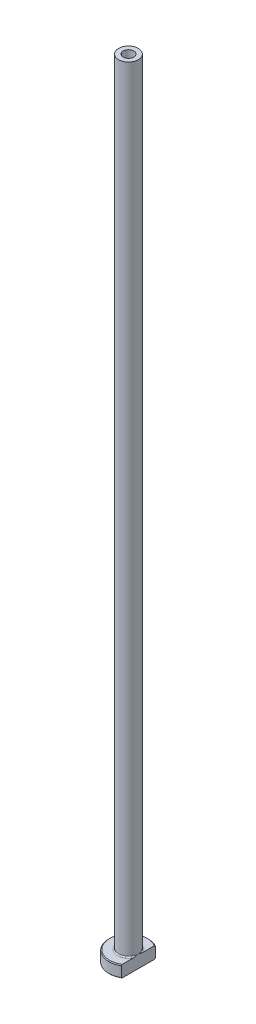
ISO-10303-21;
HEADER;
FILE_DESCRIPTION(('STEP AP214'),'2;1');
FILE_NAME('part.step','',(''),(''),'','','');
FILE_SCHEMA(('AUTOMOTIVE_DESIGN { 1 0 10303 214 1 1 1 1 }'));
ENDSEC;
DATA;
#1=APPLICATION_CONTEXT('core data for automotive mechanical design processes');
#2=APPLICATION_PROTOCOL_DEFINITION('international standard','automotive_design',2000,#1);
#3=PRODUCT_CONTEXT('',#1,'mechanical');
#4=PRODUCT('Part','Part','',(#3));
#5=PRODUCT_RELATED_PRODUCT_CATEGORY('part','',(#4));
#6=PRODUCT_DEFINITION_FORMATION('','',#4);
#7=PRODUCT_DEFINITION_CONTEXT('part definition',#1,'design');
#8=PRODUCT_DEFINITION('design','',#6,#7);
#9=PRODUCT_DEFINITION_SHAPE('','',#8);
#10=(LENGTH_UNIT() NAMED_UNIT(*) SI_UNIT(.MILLI.,.METRE.));
#11=(NAMED_UNIT(*) PLANE_ANGLE_UNIT() SI_UNIT($,.RADIAN.));
#12=(NAMED_UNIT(*) SI_UNIT($,.STERADIAN.) SOLID_ANGLE_UNIT());
#13=UNCERTAINTY_MEASURE_WITH_UNIT(LENGTH_MEASURE(1.E-05),#10,'distance_accuracy_value','');
#14=(GEOMETRIC_REPRESENTATION_CONTEXT(3) GLOBAL_UNCERTAINTY_ASSIGNED_CONTEXT((#13)) GLOBAL_UNIT_ASSIGNED_CONTEXT((#10,
#11,#12)) REPRESENTATION_CONTEXT('',''));
#15=CARTESIAN_POINT('',(0.,0.,0.));
#16=DIRECTION('',(0.,0.,1.));
#17=DIRECTION('',(1.,0.,0.));
#18=AXIS2_PLACEMENT_3D('',#15,#16,#17);
#19=CARTESIAN_POINT('',(0.,92.1876809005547,0.));
#20=DIRECTION('',(0.,1.,0.));
#21=DIRECTION('',(0.,0.,1.));
#22=AXIS2_PLACEMENT_3D('',#19,#20,#21);
#23=CYLINDRICAL_SURFACE('',#22,1.35);
#24=CARTESIAN_POINT('',(0.,200.,0.));
#25=DIRECTION('',(0.,1.,0.));
#26=DIRECTION('',(0.,0.,1.));
#27=AXIS2_PLACEMENT_3D('',#24,#25,#26);
#28=CIRCLE('',#27,1.35);
#29=CARTESIAN_POINT('',(0.,200.,1.35));
#30=VERTEX_POINT('',#29);
#31=EDGE_CURVE('E167',#30,#30,#28,.T.);
#32=ORIENTED_EDGE('',*,*,#31,.T.);
#33=EDGE_LOOP('',(#32));
#34=FACE_BOUND('',#33,.T.);
#35=CARTESIAN_POINT('',(0.,155.,0.));
#36=DIRECTION('',(0.,1.,0.));
#37=DIRECTION('',(0.,0.,1.));
#38=AXIS2_PLACEMENT_3D('',#35,#36,#37);
#39=CIRCLE('',#38,1.35);
#40=CARTESIAN_POINT('',(0.,155.,1.35));
#41=VERTEX_POINT('',#40);
#42=EDGE_CURVE('E170',#41,#41,#39,.T.);
#43=ORIENTED_EDGE('',*,*,#42,.F.);
#44=EDGE_LOOP('',(#43));
#45=FACE_BOUND('',#44,.T.);
#46=ADVANCED_FACE('F32',(#34,#45),#23,.F.);
#47=CARTESIAN_POINT('',(-1.35,200.,0.));
#48=DIRECTION('',(0.,1.,0.));
#49=DIRECTION('',(0.,0.,1.));
#50=AXIS2_PLACEMENT_3D('',#47,#48,#49);
#51=PLANE('',#50);
#52=CARTESIAN_POINT('',(0.,200.,0.));
#53=DIRECTION('',(0.,1.,0.));
#54=DIRECTION('',(0.,0.,1.));
#55=AXIS2_PLACEMENT_3D('',#52,#53,#54);
#56=CIRCLE('',#55,2.50000000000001);
#57=CARTESIAN_POINT('',(0.,200.,2.50000000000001));
#58=VERTEX_POINT('',#57);
#59=EDGE_CURVE('E174',#58,#58,#56,.T.);
#60=ORIENTED_EDGE('',*,*,#59,.T.);
#61=EDGE_LOOP('',(#60));
#62=FACE_BOUND('',#61,.T.);
#63=ORIENTED_EDGE('',*,*,#31,.F.);
#64=EDGE_LOOP('',(#63));
#65=FACE_BOUND('',#64,.T.);
#66=ADVANCED_FACE('F157',(#62,#65),#51,.T.);
#67=CARTESIAN_POINT('',(0.,92.1876809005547,0.));
#68=DIRECTION('',(0.,1.,0.));
#69=DIRECTION('',(0.,0.,1.));
#70=AXIS2_PLACEMENT_3D('',#67,#68,#69);
#71=CYLINDRICAL_SURFACE('',#70,2.5);
#72=CARTESIAN_POINT('',(0.,3.3,0.));
#73=DIRECTION('',(0.,1.,0.));
#74=DIRECTION('',(0.,0.,1.));
#75=AXIS2_PLACEMENT_3D('',#72,#73,#74);
#76=CIRCLE('',#75,2.5);
#77=CARTESIAN_POINT('',(2.5,3.3,0.));
#78=VERTEX_POINT('',#77);
#79=EDGE_CURVE('E180',#78,#78,#76,.T.);
#80=ORIENTED_EDGE('',*,*,#79,.T.);
#81=EDGE_LOOP('',(#80));
#82=FACE_BOUND('',#81,.T.);
#83=ORIENTED_EDGE('',*,*,#59,.F.);
#84=EDGE_LOOP('',(#83));
#85=FACE_BOUND('',#84,.T.);
#86=ADVANCED_FACE('F162',(#82,#85),#71,.T.);
#87=CARTESIAN_POINT('',(-2.49999999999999,3.,0.));
#88=DIRECTION('',(0.,1.,0.));
#89=DIRECTION('',(0.,0.,1.));
#90=AXIS2_PLACEMENT_3D('',#87,#88,#89);
#91=PLANE('',#90);
#92=DIRECTION('',(0.,0.,1.));
#93=VECTOR('',#92,1.);
#94=CARTESIAN_POINT('',(2.5,3.,0.));
#95=LINE('',#94,#93);
#96=CARTESIAN_POINT('',(2.5,3.,-4.09756024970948));
#97=VERTEX_POINT('',#96);
#98=CARTESIAN_POINT('',(2.5,3.,-1.26095202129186));
#99=VERTEX_POINT('',#98);
#100=EDGE_CURVE('E54',#97,#99,#95,.T.);
#101=ORIENTED_EDGE('',*,*,#100,.F.);
#102=CARTESIAN_POINT('',(0.,3.,0.));
#103=DIRECTION('',(0.,1.,0.));
#104=DIRECTION('',(0.,0.,1.));
#105=AXIS2_PLACEMENT_3D('',#102,#103,#104);
#106=CIRCLE('',#105,4.79999999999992);
#107=CARTESIAN_POINT('',(2.49999999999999,3.,4.09756024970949));
#108=VERTEX_POINT('',#107);
#109=EDGE_CURVE('E186',#97,#108,#106,.T.);
#110=ORIENTED_EDGE('',*,*,#109,.T.);
#111=CARTESIAN_POINT('',(2.5,3.,1.26095202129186));
#112=VERTEX_POINT('',#111);
#113=EDGE_CURVE('E134',#112,#108,#95,.T.);
#114=ORIENTED_EDGE('',*,*,#113,.F.);
#115=CARTESIAN_POINT('',(0.,3.,0.));
#116=DIRECTION('',(0.,1.,0.));
#117=DIRECTION('',(0.,0.,1.));
#118=AXIS2_PLACEMENT_3D('',#115,#116,#117);
#119=CIRCLE('',#118,2.8);
#120=EDGE_CURVE('E183',#112,#99,#119,.F.);
#121=ORIENTED_EDGE('',*,*,#120,.T.);
#122=EDGE_LOOP('',(#101,#110,#114,#121));
#123=FACE_BOUND('',#122,.T.);
#124=ADVANCED_FACE('F197',(#123),#91,.T.);
#125=CARTESIAN_POINT('',(0.,92.1876809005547,0.));
#126=DIRECTION('',(0.,1.,0.));
#127=DIRECTION('',(0.,0.,1.));
#128=AXIS2_PLACEMENT_3D('',#125,#126,#127);
#129=CYLINDRICAL_SURFACE('',#128,4.99999999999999);
#130=DIRECTION('',(0.,-1.,0.));
#131=VECTOR('',#130,1.);
#132=CARTESIAN_POINT('',(2.49999999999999,200.,4.33012701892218));
#133=LINE('',#132,#131);
#134=CARTESIAN_POINT('',(2.49999999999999,2.79999999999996,4.33012701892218));
#135=VERTEX_POINT('',#134);
#136=CARTESIAN_POINT('',(2.49999999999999,0.199999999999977,4.33012701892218));
#137=VERTEX_POINT('',#136);
#138=EDGE_CURVE('E82',#135,#137,#133,.T.);
#139=ORIENTED_EDGE('',*,*,#138,.F.);
#140=CARTESIAN_POINT('',(0.,2.79999999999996,0.));
#141=DIRECTION('',(0.,1.,0.));
#142=DIRECTION('',(0.,0.,1.));
#143=AXIS2_PLACEMENT_3D('',#140,#141,#142);
#144=CIRCLE('',#143,4.99999999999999);
#145=CARTESIAN_POINT('',(2.5,2.79999999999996,-4.33012701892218));
#146=VERTEX_POINT('',#145);
#147=EDGE_CURVE('E95',#135,#146,#144,.F.);
#148=ORIENTED_EDGE('',*,*,#147,.T.);
#149=DIRECTION('',(0.,-1.,0.));
#150=VECTOR('',#149,1.);
#151=CARTESIAN_POINT('',(2.5,200.,-4.33012701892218));
#152=LINE('',#151,#150);
#153=CARTESIAN_POINT('',(2.5,0.199999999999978,-4.33012701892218));
#154=VERTEX_POINT('',#153);
#155=EDGE_CURVE('E192',#146,#154,#152,.T.);
#156=ORIENTED_EDGE('',*,*,#155,.T.);
#157=CARTESIAN_POINT('',(0.,0.199999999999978,0.));
#158=DIRECTION('',(0.,-1.,0.));
#159=DIRECTION('',(0.,0.,-1.));
#160=AXIS2_PLACEMENT_3D('',#157,#158,#159);
#161=CIRCLE('',#160,4.99999999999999);
#162=EDGE_CURVE('E98',#154,#137,#161,.F.);
#163=ORIENTED_EDGE('',*,*,#162,.T.);
#164=EDGE_LOOP('',(#139,#148,#156,#163));
#165=FACE_BOUND('',#164,.T.);
#166=ADVANCED_FACE('F190',(#165),#129,.T.);
#167=CARTESIAN_POINT('',(-4.99999999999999,0.,0.));
#168=DIRECTION('',(0.,-1.,0.));
#169=DIRECTION('',(0.,0.,-1.));
#170=AXIS2_PLACEMENT_3D('',#167,#168,#169);
#171=PLANE('',#170);
#172=CARTESIAN_POINT('',(0.,0.,0.));
#173=DIRECTION('',(0.,-1.,0.));
#174=DIRECTION('',(0.,0.,-1.));
#175=AXIS2_PLACEMENT_3D('',#172,#173,#174);
#176=CIRCLE('',#175,2.09999999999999);
#177=CARTESIAN_POINT('',(0.,0.,-2.09999999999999));
#178=VERTEX_POINT('',#177);
#179=EDGE_CURVE('E40',#178,#178,#176,.F.);
#180=ORIENTED_EDGE('',*,*,#179,.T.);
#181=EDGE_LOOP('',(#180));
#182=FACE_BOUND('',#181,.T.);
#183=DIRECTION('',(0.,0.,-1.));
#184=VECTOR('',#183,1.);
#185=CARTESIAN_POINT('',(2.49999999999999,0.,4.33012701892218));
#186=LINE('',#185,#184);
#187=CARTESIAN_POINT('',(2.49999999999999,0.,4.09756024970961));
#188=VERTEX_POINT('',#187);
#189=CARTESIAN_POINT('',(2.5,0.,-4.09756024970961));
#190=VERTEX_POINT('',#189);
#191=EDGE_CURVE('E47',#188,#190,#186,.T.);
#192=ORIENTED_EDGE('',*,*,#191,.F.);
#193=CARTESIAN_POINT('',(0.,0.,0.));
#194=DIRECTION('',(0.,-1.,0.));
#195=DIRECTION('',(0.,0.,-1.));
#196=AXIS2_PLACEMENT_3D('',#193,#194,#195);
#197=CIRCLE('',#196,4.80000000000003);
#198=EDGE_CURVE('E92',#188,#190,#197,.T.);
#199=ORIENTED_EDGE('',*,*,#198,.T.);
#200=EDGE_LOOP('',(#192,#199));
#201=FACE_BOUND('',#200,.T.);
#202=ADVANCED_FACE('F91',(#182,#201),#171,.T.);
#203=CARTESIAN_POINT('',(0.,92.1876809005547,0.));
#204=DIRECTION('',(0.,1.,0.));
#205=DIRECTION('',(0.,0.,1.));
#206=AXIS2_PLACEMENT_3D('',#203,#204,#205);
#207=CYLINDRICAL_SURFACE('',#206,1.6);
#208=CARTESIAN_POINT('',(0.,0.500000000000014,0.));
#209=DIRECTION('',(0.,-1.,0.));
#210=DIRECTION('',(0.,0.,-1.));
#211=AXIS2_PLACEMENT_3D('',#208,#209,#210);
#212=CIRCLE('',#211,1.6);
#213=CARTESIAN_POINT('',(0.,0.500000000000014,-1.6));
#214=VERTEX_POINT('',#213);
#215=EDGE_CURVE('E11',#214,#214,#212,.T.);
#216=ORIENTED_EDGE('',*,*,#215,.T.);
#217=EDGE_LOOP('',(#216));
#218=FACE_BOUND('',#217,.T.);
#219=CARTESIAN_POINT('',(0.,143.,0.));
#220=DIRECTION('',(0.,1.,0.));
#221=DIRECTION('',(0.,0.,1.));
#222=AXIS2_PLACEMENT_3D('',#219,#220,#221);
#223=CIRCLE('',#222,1.60000000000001);
#224=CARTESIAN_POINT('',(0.,143.,1.60000000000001));
#225=VERTEX_POINT('',#224);
#226=EDGE_CURVE('E172',#225,#225,#223,.T.);
#227=ORIENTED_EDGE('',*,*,#226,.T.);
#228=EDGE_LOOP('',(#227));
#229=FACE_BOUND('',#228,.T.);
#230=ADVANCED_FACE('F215',(#218,#229),#207,.F.);
#231=CARTESIAN_POINT('',(0.,143.,0.));
#232=DIRECTION('',(0.,-1.,0.));
#233=DIRECTION('',(0.,0.,-1.));
#234=AXIS2_PLACEMENT_3D('',#231,#232,#233);
#235=CONICAL_SURFACE('',#234,1.60000000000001,0.0208303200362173);
#236=ORIENTED_EDGE('',*,*,#42,.T.);
#237=EDGE_LOOP('',(#236));
#238=FACE_BOUND('',#237,.T.);
#239=ORIENTED_EDGE('',*,*,#226,.F.);
#240=EDGE_LOOP('',(#239));
#241=FACE_BOUND('',#240,.T.);
#242=ADVANCED_FACE('F111',(#238,#241),#235,.F.);
#243=CARTESIAN_POINT('',(0.,3.3,0.));
#244=DIRECTION('',(0.,1.,0.));
#245=DIRECTION('',(0.,0.,1.));
#246=AXIS2_PLACEMENT_3D('',#243,#244,#245);
#247=TOROIDAL_SURFACE('',#246,2.8,0.3);
#248=ORIENTED_EDGE('',*,*,#120,.F.);
#249=CARTESIAN_POINT('',(2.5,3.3,0.));
#250=CARTESIAN_POINT('',(2.5,3.30000062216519,-4.84268980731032E-11));
#251=CARTESIAN_POINT('',(2.5,3.3000012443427,1.59621044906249E-07));
#252=CARTESIAN_POINT('',(2.5,3.30000243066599,6.45477949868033E-07));
#253=CARTESIAN_POINT('',(2.5,3.30000299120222,9.78480688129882E-07));
#254=CARTESIAN_POINT('',(2.5,3.30000411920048,1.77471979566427E-06));
#255=CARTESIAN_POINT('',(2.5,3.30000467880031,2.24902143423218E-06));
#256=CARTESIAN_POINT('',(2.5,3.30000572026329,3.25953681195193E-06));
#257=CARTESIAN_POINT('',(2.5,3.30000620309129,3.79480743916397E-06));
#258=CARTESIAN_POINT('',(2.5,3.3000078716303,5.75794639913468E-06));
#259=CARTESIAN_POINT('',(2.5,3.30000896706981,7.26424134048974E-06));
#260=CARTESIAN_POINT('',(2.5,3.30001087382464,1.03361133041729E-05));
#261=CARTESIAN_POINT('',(2.5,3.30001169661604,1.18949502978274E-05));
#262=CARTESIAN_POINT('',(2.5,3.30001489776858,1.81400858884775E-05));
#263=CARTESIAN_POINT('',(2.5,3.30001712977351,2.29062187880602E-05));
#264=CARTESIAN_POINT('',(2.5,3.30002067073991,3.21793879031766E-05));
#265=CARTESIAN_POINT('',(2.5,3.3000220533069,3.66589000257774E-05));
#266=CARTESIAN_POINT('',(2.5,3.30002810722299,5.61718422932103E-05));
#267=CARTESIAN_POINT('',(2.5,3.30003284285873,7.11735890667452E-05));
#268=CARTESIAN_POINT('',(2.5,3.30004025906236,9.89920358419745E-05));
#269=CARTESIAN_POINT('',(2.5,3.30004315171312,0.000111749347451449));
#270=CARTESIAN_POINT('',(2.49999999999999,3.3000665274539,0.000206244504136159));
#271=CARTESIAN_POINT('',(2.49999999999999,3.30009698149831,0.000285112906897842));
#272=CARTESIAN_POINT('',(2.5,3.30021213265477,0.000594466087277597));
#273=CARTESIAN_POINT('',(2.5,3.30028938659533,0.00082694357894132));
#274=CARTESIAN_POINT('',(2.49999999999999,3.30059681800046,0.00173885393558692));
#275=CARTESIAN_POINT('',(2.49999999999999,3.30083479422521,0.00241625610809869));
#276=CARTESIAN_POINT('',(2.5,3.30181198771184,0.00521069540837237));
#277=CARTESIAN_POINT('',(2.5,3.30254240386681,0.00732996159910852));
#278=CARTESIAN_POINT('',(2.49999999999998,3.31226043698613,0.0355096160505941));
#279=CARTESIAN_POINT('',(2.49999999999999,3.3213080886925,0.0615551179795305));
#280=CARTESIAN_POINT('',(2.5,3.33896212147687,0.112677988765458));
#281=CARTESIAN_POINT('',(2.5,3.34757212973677,0.137754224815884));
#282=CARTESIAN_POINT('',(2.49999999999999,3.36573068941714,0.190981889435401));
#283=CARTESIAN_POINT('',(2.49999999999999,3.37526654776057,0.219137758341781));
#284=CARTESIAN_POINT('',(2.5,3.39422867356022,0.275816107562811));
#285=CARTESIAN_POINT('',(2.5,3.40365272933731,0.30433932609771));
#286=CARTESIAN_POINT('',(2.5,3.42641697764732,0.374416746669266));
#287=CARTESIAN_POINT('',(2.5,3.43959811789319,0.416023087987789));
#288=CARTESIAN_POINT('',(2.5,3.46479157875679,0.498481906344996));
#289=CARTESIAN_POINT('',(2.5,3.47682455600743,0.539328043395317));
#290=CARTESIAN_POINT('',(2.5,3.50224427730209,0.629981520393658));
#291=CARTESIAN_POINT('',(2.5,3.51538048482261,0.679860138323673));
#292=CARTESIAN_POINT('',(2.5,3.53964074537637,0.780511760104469));
#293=CARTESIAN_POINT('',(2.5,3.55074877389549,0.831288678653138));
#294=CARTESIAN_POINT('',(2.5,3.57087054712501,0.937063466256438));
#295=CARTESIAN_POINT('',(2.5,3.57967623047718,0.992102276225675));
#296=CARTESIAN_POINT('',(2.5,3.59301148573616,1.10256024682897));
#297=CARTESIAN_POINT('',(2.5,3.59755297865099,1.15797790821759));
#298=CARTESIAN_POINT('',(2.5,3.60093314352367,1.26786705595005));
#299=CARTESIAN_POINT('',(2.5,3.59989366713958,1.32233291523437));
#300=CARTESIAN_POINT('',(2.5,3.59277279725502,1.40310062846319));
#301=CARTESIAN_POINT('',(2.5,3.58952137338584,1.42965222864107));
#302=CARTESIAN_POINT('',(2.5,3.58085857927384,1.48239078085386));
#303=CARTESIAN_POINT('',(2.5,3.5754492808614,1.50857805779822));
#304=CARTESIAN_POINT('',(2.5,3.56298810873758,1.55658799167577));
#305=CARTESIAN_POINT('',(2.5,3.55628200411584,1.57849902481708));
#306=CARTESIAN_POINT('',(2.5,3.54055393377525,1.62160292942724));
#307=CARTESIAN_POINT('',(2.5,3.53152220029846,1.6427923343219));
#308=CARTESIAN_POINT('',(2.5,3.51057199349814,1.68404469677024));
#309=CARTESIAN_POINT('',(2.5,3.49862012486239,1.70409105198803));
#310=CARTESIAN_POINT('',(2.5,3.47134074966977,1.74172093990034));
#311=CARTESIAN_POINT('',(2.5,3.45603127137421,1.75931683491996));
#312=CARTESIAN_POINT('',(2.5,3.42979930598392,1.78297070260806));
#313=CARTESIAN_POINT('',(2.5,3.4202426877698,1.79054141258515));
#314=CARTESIAN_POINT('',(2.5,3.40009035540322,1.80416997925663));
#315=CARTESIAN_POINT('',(2.5,3.38949499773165,1.81022835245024));
#316=CARTESIAN_POINT('',(2.5,3.36727740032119,1.82047087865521));
#317=CARTESIAN_POINT('',(2.5,3.35564531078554,1.82463409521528));
#318=CARTESIAN_POINT('',(2.5,3.3317883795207,1.83058442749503));
#319=CARTESIAN_POINT('',(2.5,3.31956435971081,1.83237474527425));
#320=CARTESIAN_POINT('',(2.5,3.29665736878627,1.83331852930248));
#321=CARTESIAN_POINT('',(2.5,3.28598670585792,1.83279233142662));
#322=CARTESIAN_POINT('',(2.5,3.26490749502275,1.82986307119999));
#323=CARTESIAN_POINT('',(2.5,3.2544989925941,1.82745968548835));
#324=CARTESIAN_POINT('',(2.5,3.23467098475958,1.82111257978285));
#325=CARTESIAN_POINT('',(2.5,3.22522816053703,1.81724026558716));
#326=CARTESIAN_POINT('',(2.5,3.20699535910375,1.80819497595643));
#327=CARTESIAN_POINT('',(2.5,3.19820556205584,1.80302164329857));
#328=CARTESIAN_POINT('',(2.5,3.17663162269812,1.78842115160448));
#329=CARTESIAN_POINT('',(2.5,3.16436228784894,1.77823293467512));
#330=CARTESIAN_POINT('',(2.5,3.14157828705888,1.75604629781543));
#331=CARTESIAN_POINT('',(2.5,3.13106906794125,1.74404246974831));
#332=CARTESIAN_POINT('',(2.5,3.10600520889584,1.71142114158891));
#333=CARTESIAN_POINT('',(2.5,3.09267476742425,1.68986887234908));
#334=CARTESIAN_POINT('',(2.5,3.06940323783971,1.64508572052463));
#335=CARTESIAN_POINT('',(2.5,3.05946314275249,1.62185434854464));
#336=CARTESIAN_POINT('',(2.5,3.03545750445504,1.55546754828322));
#337=CARTESIAN_POINT('',(2.5,3.02444022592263,1.51122187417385));
#338=CARTESIAN_POINT('',(2.5,3.00863926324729,1.42119777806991));
#339=CARTESIAN_POINT('',(2.5,3.00393876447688,1.37540689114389));
#340=CARTESIAN_POINT('',(2.5,2.9992421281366,1.28072198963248));
#341=CARTESIAN_POINT('',(2.5,2.99956098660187,1.23181420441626));
#342=CARTESIAN_POINT('',(2.5,3.00436098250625,1.13410944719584));
#343=CARTESIAN_POINT('',(2.5,3.00885327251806,1.08531312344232));
#344=CARTESIAN_POINT('',(2.5,3.02074191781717,0.990773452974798));
#345=CARTESIAN_POINT('',(2.5,3.02796792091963,0.94500781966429));
#346=CARTESIAN_POINT('',(2.5,3.04465555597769,0.854199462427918));
#347=CARTESIAN_POINT('',(2.5,3.05410250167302,0.809153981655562));
#348=CARTESIAN_POINT('',(2.5,3.07710029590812,0.709411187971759));
#349=CARTESIAN_POINT('',(2.5,3.09109633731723,0.654817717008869));
#350=CARTESIAN_POINT('',(2.5,3.12140740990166,0.544863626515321));
#351=CARTESIAN_POINT('',(2.49999999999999,3.13777040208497,0.489516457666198));
#352=CARTESIAN_POINT('',(2.5,3.16649540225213,0.39674060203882));
#353=CARTESIAN_POINT('',(2.5,3.17848130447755,0.359193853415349));
#354=CARTESIAN_POINT('',(2.49999999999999,3.20280507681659,0.284651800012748));
#355=CARTESIAN_POINT('',(2.49999999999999,3.21513791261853,0.247654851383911));
#356=CARTESIAN_POINT('',(2.5,3.23873713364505,0.177767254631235));
#357=CARTESIAN_POINT('',(2.50000000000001,3.24997409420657,0.144866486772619));
#358=CARTESIAN_POINT('',(2.49999999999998,3.27307149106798,0.0777985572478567));
#359=CARTESIAN_POINT('',(2.49999999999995,3.28493883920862,0.043633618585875));
#360=CARTESIAN_POINT('',(2.5,3.29745794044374,0.00732879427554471));
#361=CARTESIAN_POINT('',(2.5,3.29818879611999,0.00520838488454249));
#362=CARTESIAN_POINT('',(2.49999999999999,3.29916610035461,0.00241367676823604));
#363=CARTESIAN_POINT('',(2.49999999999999,3.29940376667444,0.00173715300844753));
#364=CARTESIAN_POINT('',(2.5,3.29971082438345,0.000826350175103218));
#365=CARTESIAN_POINT('',(2.5,3.29978800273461,0.000594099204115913));
#366=CARTESIAN_POINT('',(2.49999999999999,3.29990305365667,0.000285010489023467));
#367=CARTESIAN_POINT('',(2.49999999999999,3.29993349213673,0.00020618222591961));
#368=CARTESIAN_POINT('',(2.5,3.29995685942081,0.000111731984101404));
#369=CARTESIAN_POINT('',(2.5,3.29995975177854,9.89774347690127E-05));
#370=CARTESIAN_POINT('',(2.5,3.29996716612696,7.11651903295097E-05));
#371=CARTESIAN_POINT('',(2.5,3.29997189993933,5.61668109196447E-05));
#372=CARTESIAN_POINT('',(2.5,3.29997795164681,3.66576335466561E-05));
#373=CARTESIAN_POINT('',(2.5,3.2999793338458,3.21785252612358E-05));
#374=CARTESIAN_POINT('',(2.5,3.29998287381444,2.29061380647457E-05));
#375=CARTESIAN_POINT('',(2.5,3.29998510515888,1.81403664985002E-05));
#376=CARTESIAN_POINT('',(2.5,3.29998830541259,1.18955823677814E-05));
#377=CARTESIAN_POINT('',(2.5,3.29998912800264,1.03367763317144E-05));
#378=CARTESIAN_POINT('',(2.5,3.29999103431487,7.26492789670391E-06));
#379=CARTESIAN_POINT('',(2.5,3.29999212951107,5.75862280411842E-06));
#380=CARTESIAN_POINT('',(2.5,3.29999379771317,3.79542459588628E-06));
#381=CARTESIAN_POINT('',(2.5,3.29999428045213,3.26012752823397E-06));
#382=CARTESIAN_POINT('',(2.5,3.29999532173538,2.24954324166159E-06));
#383=CARTESIAN_POINT('',(2.5,3.29999588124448,1.77519885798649E-06));
#384=CARTESIAN_POINT('',(2.5,3.29999700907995,9.78857025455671E-07));
#385=CARTESIAN_POINT('',(2.5,3.29999756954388,6.45796999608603E-07));
#386=CARTESIAN_POINT('',(2.5,3.29999875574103,1.59799582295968E-07));
#387=CARTESIAN_POINT('',(2.5,3.29999937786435,4.84250995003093E-11));
#388=CARTESIAN_POINT('',(2.5,3.3,0.));
#389=B_SPLINE_CURVE_WITH_KNOTS('',3,(#249,#250,#251,#252,#253,#254,#255,#256,#257,#258,#259,
#260,#261,#262,#263,#264,#265,#266,#267,#268,#269,#270,#271,#272,#273,#274,#275,#276,#277,#278,
#279,#280,#281,#282,#283,#284,#285,#286,#287,#288,#289,#290,#291,#292,#293,#294,#295,#296,#297,
#298,#299,#300,#301,#302,#303,#304,#305,#306,#307,#308,#309,#310,#311,#312,#313,#314,#315,#316,
#317,#318,#319,#320,#321,#322,#323,#324,#325,#326,#327,#328,#329,#330,#331,#332,#333,#334,#335,
#336,#337,#338,#339,#340,#341,#342,#343,#344,#345,#346,#347,#348,#349,#350,#351,#352,#353,#354,
#355,#356,#357,#358,#359,#360,#361,#362,#363,#364,#365,#366,#367,#368,#369,#370,#371,#372,#373,
#374,#375,#376,#377,#378,#379,#380,#381,#382,#383,#384,#385,#386,#387,#388),.UNSPECIFIED.,.T.,
.F.,(4,2,2,2,2,2,2,2,2,2,2,2,2,2,2,2,2,2,2,2,2,2,2,2,2,2,2,2,2,2,2,2,2,2,2,2,2,2,2,2,2,2,2,2,2,
2,2,2,2,2,2,2,2,2,2,2,2,2,2,2,2,2,2,2,2,2,2,2,2,4),(0.,1.86789206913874E-06,3.8154956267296E-06,
6.00610403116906E-06,8.16652880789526E-06,1.37285579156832E-05,1.90122157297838E-05,
3.47597277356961E-05,4.88082602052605E-05,9.59978438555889E-05,0.00013520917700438,
0.000388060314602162,0.00112364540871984,0.00327678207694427,0.0100024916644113,
0.0927120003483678,0.172253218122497,0.261432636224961,0.351551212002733,0.48247714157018,
0.610212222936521,0.764915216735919,0.920792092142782,1.08787897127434,1.25449733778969,
1.41749285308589,1.49767530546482,1.57778095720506,1.64642481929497,1.71536183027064,
1.7851275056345,1.85452737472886,1.89099315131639,1.92744645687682,1.96429324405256,
2.00109025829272,2.03297105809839,2.06485735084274,2.09535926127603,2.12586955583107,
2.17344034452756,2.22115572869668,2.29675134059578,2.37236907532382,2.50839721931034,
2.64619971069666,2.79268284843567,2.93955855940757,3.07848421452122,3.21651583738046,
3.38554045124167,3.5586593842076,3.67689643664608,3.79388863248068,3.89819085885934,
4.00668323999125,4.01341261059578,4.01556295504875,4.01629782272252,4.01655054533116,
4.01658974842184,4.01663692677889,4.01665097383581,4.0166667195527,4.01667200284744,
4.01667756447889,4.01667972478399,4.01668191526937,4.01668386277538,4.01668573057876),.UNSPECIFIED.);
#390=EDGE_CURVE('E126',#112,#78,#389,.T.);
#391=ORIENTED_EDGE('',*,*,#390,.T.);
#392=ORIENTED_EDGE('',*,*,#79,.F.);
#393=CARTESIAN_POINT('',(2.5,3.3,0.));
#394=CARTESIAN_POINT('',(2.5,3.29999937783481,4.84273436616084E-11));
#395=CARTESIAN_POINT('',(2.5,3.29999875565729,-1.59621044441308E-07));
#396=CARTESIAN_POINT('',(2.5,3.29999756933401,-6.45477949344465E-07));
#397=CARTESIAN_POINT('',(2.5,3.29999700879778,-9.78480687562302E-07));
#398=CARTESIAN_POINT('',(2.5,3.29999588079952,-1.77471979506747E-06));
#399=CARTESIAN_POINT('',(2.5,3.29999532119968,-2.24902143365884E-06));
#400=CARTESIAN_POINT('',(2.5,3.29999427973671,-3.25953681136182E-06));
#401=CARTESIAN_POINT('',(2.5,3.2999937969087,-3.79480743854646E-06));
#402=CARTESIAN_POINT('',(2.5,3.2999921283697,-5.75794639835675E-06));
#403=CARTESIAN_POINT('',(2.5,3.29999103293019,-7.26424133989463E-06));
#404=CARTESIAN_POINT('',(2.5,3.29998912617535,-1.03361133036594E-05));
#405=CARTESIAN_POINT('',(2.5,3.29998830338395,-1.18949502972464E-05));
#406=CARTESIAN_POINT('',(2.5,3.29998510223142,-1.81400858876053E-05));
#407=CARTESIAN_POINT('',(2.5,3.29998287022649,-2.29062187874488E-05));
#408=CARTESIAN_POINT('',(2.5,3.29997932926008,-3.21793879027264E-05));
#409=CARTESIAN_POINT('',(2.5,3.2999779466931,-3.66589000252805E-05));
#410=CARTESIAN_POINT('',(2.5,3.299971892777,-5.6171842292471E-05));
#411=CARTESIAN_POINT('',(2.5,3.29996715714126,-7.11735890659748E-05));
#412=CARTESIAN_POINT('',(2.49999999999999,3.29995974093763,-9.89920358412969E-05));
#413=CARTESIAN_POINT('',(2.5,3.29995684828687,-0.000111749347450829));
#414=CARTESIAN_POINT('',(2.5,3.29993347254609,-0.000206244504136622));
#415=CARTESIAN_POINT('',(2.5,3.29990301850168,-0.00028511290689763));
#416=CARTESIAN_POINT('',(2.49999999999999,3.29978786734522,-0.000594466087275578));
#417=CARTESIAN_POINT('',(2.49999999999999,3.29971061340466,-0.000826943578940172));
#418=CARTESIAN_POINT('',(2.5,3.29940318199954,-0.00173885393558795));
#419=CARTESIAN_POINT('',(2.5,3.29916520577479,-0.0024162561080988));
#420=CARTESIAN_POINT('',(2.49999999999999,3.29818801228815,-0.00521069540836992));
#421=CARTESIAN_POINT('',(2.49999999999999,3.29745759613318,-0.00732996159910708));
#422=CARTESIAN_POINT('',(2.5,3.28773956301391,-0.0355096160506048));
#423=CARTESIAN_POINT('',(2.5,3.2786919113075,-0.0615551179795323));
#424=CARTESIAN_POINT('',(2.49999999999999,3.26103787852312,-0.112677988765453));
#425=CARTESIAN_POINT('',(2.49999999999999,3.25242787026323,-0.137754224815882));
#426=CARTESIAN_POINT('',(2.5,3.23426931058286,-0.1909818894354));
#427=CARTESIAN_POINT('',(2.5,3.22473345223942,-0.219137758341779));
#428=CARTESIAN_POINT('',(2.5,3.20577132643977,-0.275816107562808));
#429=CARTESIAN_POINT('',(2.5,3.19634727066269,-0.304339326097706));
#430=CARTESIAN_POINT('',(2.5,3.17358302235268,-0.374416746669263));
#431=CARTESIAN_POINT('',(2.5,3.16040188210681,-0.416023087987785));
#432=CARTESIAN_POINT('',(2.5,3.13520842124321,-0.498481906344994));
#433=CARTESIAN_POINT('',(2.5,3.12317544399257,-0.539328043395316));
#434=CARTESIAN_POINT('',(2.5,3.0977557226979,-0.629981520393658));
#435=CARTESIAN_POINT('',(2.5,3.08461951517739,-0.679860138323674));
#436=CARTESIAN_POINT('',(2.5,3.06035925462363,-0.78051176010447));
#437=CARTESIAN_POINT('',(2.5,3.0492512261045,-0.831288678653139));
#438=CARTESIAN_POINT('',(2.5,3.02912945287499,-0.93706346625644));
#439=CARTESIAN_POINT('',(2.5,3.02032376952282,-0.992102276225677));
#440=CARTESIAN_POINT('',(2.5,3.00698851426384,-1.10256024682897));
#441=CARTESIAN_POINT('',(2.5,3.002447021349,-1.15797790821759));
#442=CARTESIAN_POINT('',(2.5,2.99906685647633,-1.26786705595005));
#443=CARTESIAN_POINT('',(2.5,3.00010633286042,-1.32233291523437));
#444=CARTESIAN_POINT('',(2.5,3.00722720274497,-1.40310062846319));
#445=CARTESIAN_POINT('',(2.5,3.01047862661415,-1.42965222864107));
#446=CARTESIAN_POINT('',(2.5,3.01914142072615,-1.48239078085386));
#447=CARTESIAN_POINT('',(2.5,3.0245507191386,-1.50857805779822));
#448=CARTESIAN_POINT('',(2.5,3.03701189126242,-1.55658799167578));
#449=CARTESIAN_POINT('',(2.5,3.04371799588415,-1.57849902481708));
#450=CARTESIAN_POINT('',(2.5,3.05944606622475,-1.62160292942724));
#451=CARTESIAN_POINT('',(2.5,3.06847779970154,-1.6427923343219));
#452=CARTESIAN_POINT('',(2.5,3.08942800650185,-1.68404469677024));
#453=CARTESIAN_POINT('',(2.5,3.1013798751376,-1.70409105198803));
#454=CARTESIAN_POINT('',(2.5,3.12865925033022,-1.74172093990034));
#455=CARTESIAN_POINT('',(2.5,3.14396872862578,-1.75931683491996));
#456=CARTESIAN_POINT('',(2.5,3.17020069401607,-1.78297070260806));
#457=CARTESIAN_POINT('',(2.5,3.17975731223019,-1.79054141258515));
#458=CARTESIAN_POINT('',(2.5,3.19990964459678,-1.80416997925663));
#459=CARTESIAN_POINT('',(2.5,3.21050500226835,-1.81022835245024));
#460=CARTESIAN_POINT('',(2.5,3.2327225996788,-1.82047087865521));
#461=CARTESIAN_POINT('',(2.5,3.24435468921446,-1.82463409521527));
#462=CARTESIAN_POINT('',(2.5,3.26821162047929,-1.83058442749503));
#463=CARTESIAN_POINT('',(2.5,3.28043564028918,-1.83237474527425));
#464=CARTESIAN_POINT('',(2.5,3.30334263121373,-1.83331852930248));
#465=CARTESIAN_POINT('',(2.5,3.31401329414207,-1.83279233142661));
#466=CARTESIAN_POINT('',(2.5,3.33509250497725,-1.82986307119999));
#467=CARTESIAN_POINT('',(2.5,3.3455010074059,-1.82745968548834));
#468=CARTESIAN_POINT('',(2.5,3.36532901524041,-1.82111257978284));
#469=CARTESIAN_POINT('',(2.5,3.37477183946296,-1.81724026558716));
#470=CARTESIAN_POINT('',(2.5,3.39300464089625,-1.80819497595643));
#471=CARTESIAN_POINT('',(2.5,3.40179443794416,-1.80302164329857));
#472=CARTESIAN_POINT('',(2.5,3.42336837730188,-1.78842115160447));
#473=CARTESIAN_POINT('',(2.5,3.43563771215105,-1.77823293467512));
#474=CARTESIAN_POINT('',(2.5,3.45842171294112,-1.75604629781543));
#475=CARTESIAN_POINT('',(2.5,3.46893093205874,-1.7440424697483));
#476=CARTESIAN_POINT('',(2.5,3.49399479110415,-1.71142114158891));
#477=CARTESIAN_POINT('',(2.5,3.50732523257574,-1.68986887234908));
#478=CARTESIAN_POINT('',(2.5,3.53059676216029,-1.64508572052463));
#479=CARTESIAN_POINT('',(2.5,3.54053685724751,-1.62185434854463));
#480=CARTESIAN_POINT('',(2.5,3.56454249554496,-1.55546754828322));
#481=CARTESIAN_POINT('',(2.5,3.57555977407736,-1.51122187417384));
#482=CARTESIAN_POINT('',(2.5,3.5913607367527,-1.4211977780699));
#483=CARTESIAN_POINT('',(2.5,3.59606123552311,-1.37540689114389));
#484=CARTESIAN_POINT('',(2.5,3.6007578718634,-1.28072198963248));
#485=CARTESIAN_POINT('',(2.5,3.60043901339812,-1.23181420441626));
#486=CARTESIAN_POINT('',(2.5,3.59563901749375,-1.13410944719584));
#487=CARTESIAN_POINT('',(2.5,3.59114672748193,-1.08531312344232));
#488=CARTESIAN_POINT('',(2.5,3.57925808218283,-0.990773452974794));
#489=CARTESIAN_POINT('',(2.5,3.57203207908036,-0.945007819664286));
#490=CARTESIAN_POINT('',(2.5,3.55534444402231,-0.854199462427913));
#491=CARTESIAN_POINT('',(2.5,3.54589749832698,-0.809153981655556));
#492=CARTESIAN_POINT('',(2.5,3.52289970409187,-0.709411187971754));
#493=CARTESIAN_POINT('',(2.5,3.50890366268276,-0.654817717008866));
#494=CARTESIAN_POINT('',(2.5,3.47859259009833,-0.544863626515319));
#495=CARTESIAN_POINT('',(2.49999999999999,3.46222959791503,-0.489516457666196));
#496=CARTESIAN_POINT('',(2.5,3.43350459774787,-0.39674060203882));
#497=CARTESIAN_POINT('',(2.5,3.42151869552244,-0.359193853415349));
#498=CARTESIAN_POINT('',(2.49999999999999,3.39719492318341,-0.284651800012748));
#499=CARTESIAN_POINT('',(2.49999999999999,3.38486208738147,-0.247654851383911));
#500=CARTESIAN_POINT('',(2.5,3.36126286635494,-0.177767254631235));
#501=CARTESIAN_POINT('',(2.5,3.35002590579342,-0.14486648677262));
#502=CARTESIAN_POINT('',(2.49999999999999,3.32692850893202,-0.0777985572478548));
#503=CARTESIAN_POINT('',(2.49999999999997,3.31506116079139,-0.0436336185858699));
#504=CARTESIAN_POINT('',(2.5,3.30254205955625,-0.00732879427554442));
#505=CARTESIAN_POINT('',(2.5,3.30181120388,-0.00520838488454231));
#506=CARTESIAN_POINT('',(2.49999999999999,3.30083389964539,-0.00241367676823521));
#507=CARTESIAN_POINT('',(2.49999999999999,3.30059623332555,-0.00173715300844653));
#508=CARTESIAN_POINT('',(2.5,3.30028917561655,-0.000826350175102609));
#509=CARTESIAN_POINT('',(2.5,3.30021199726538,-0.000594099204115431));
#510=CARTESIAN_POINT('',(2.49999999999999,3.30009694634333,-0.000285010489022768));
#511=CARTESIAN_POINT('',(2.49999999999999,3.30006650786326,-0.000206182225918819));
#512=CARTESIAN_POINT('',(2.5,3.30004314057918,-0.000111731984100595));
#513=CARTESIAN_POINT('',(2.5,3.30004024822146,-9.89774347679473E-05));
#514=CARTESIAN_POINT('',(2.5,3.30003283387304,-7.11651903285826E-05));
#515=CARTESIAN_POINT('',(2.5,3.30002810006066,-5.61668109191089E-05));
#516=CARTESIAN_POINT('',(2.5,3.30002204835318,-3.6657633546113E-05));
#517=CARTESIAN_POINT('',(2.5,3.30002066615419,-3.21785252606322E-05));
#518=CARTESIAN_POINT('',(2.5,3.30001712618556,-2.2906138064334E-05));
#519=CARTESIAN_POINT('',(2.5,3.30001489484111,-1.81403664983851E-05));
#520=CARTESIAN_POINT('',(2.5,3.30001169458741,-1.1895582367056E-05));
#521=CARTESIAN_POINT('',(2.5,3.30001087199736,-1.03367763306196E-05));
#522=CARTESIAN_POINT('',(2.5,3.30000896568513,-7.26492789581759E-06));
#523=CARTESIAN_POINT('',(2.5,3.30000787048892,-5.75862280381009E-06));
#524=CARTESIAN_POINT('',(2.5,3.30000620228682,-3.7954245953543E-06));
#525=CARTESIAN_POINT('',(2.5,3.30000571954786,-3.26012752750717E-06));
#526=CARTESIAN_POINT('',(2.5,3.30000467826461,-2.24954324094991E-06));
#527=CARTESIAN_POINT('',(2.5,3.30000411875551,-1.7751988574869E-06));
#528=CARTESIAN_POINT('',(2.5,3.30000299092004,-9.788570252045E-07));
#529=CARTESIAN_POINT('',(2.5,3.30000243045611,-6.45796999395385E-07));
#530=CARTESIAN_POINT('',(2.5,3.30000124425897,-1.59799581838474E-07));
#531=CARTESIAN_POINT('',(2.5,3.30000062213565,-4.84245435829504E-11));
#532=CARTESIAN_POINT('',(2.5,3.3,0.));
#533=B_SPLINE_CURVE_WITH_KNOTS('',3,(#393,#394,#395,#396,#397,#398,#399,#400,#401,#402,#403,
#404,#405,#406,#407,#408,#409,#410,#411,#412,#413,#414,#415,#416,#417,#418,#419,#420,#421,#422,
#423,#424,#425,#426,#427,#428,#429,#430,#431,#432,#433,#434,#435,#436,#437,#438,#439,#440,#441,
#442,#443,#444,#445,#446,#447,#448,#449,#450,#451,#452,#453,#454,#455,#456,#457,#458,#459,#460,
#461,#462,#463,#464,#465,#466,#467,#468,#469,#470,#471,#472,#473,#474,#475,#476,#477,#478,#479,
#480,#481,#482,#483,#484,#485,#486,#487,#488,#489,#490,#491,#492,#493,#494,#495,#496,#497,#498,
#499,#500,#501,#502,#503,#504,#505,#506,#507,#508,#509,#510,#511,#512,#513,#514,#515,#516,#517,
#518,#519,#520,#521,#522,#523,#524,#525,#526,#527,#528,#529,#530,#531,#532),.UNSPECIFIED.,.T.,
.F.,(4,2,2,2,2,2,2,2,2,2,2,2,2,2,2,2,2,2,2,2,2,2,2,2,2,2,2,2,2,2,2,2,2,2,2,2,2,2,2,2,2,2,2,2,2,
2,2,2,2,2,2,2,2,2,2,2,2,2,2,2,2,2,2,2,2,2,2,2,2,4),(0.,1.8678920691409E-06,3.81549562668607E-06,
6.00610403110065E-06,8.16652880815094E-06,1.37285579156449E-05,1.90122157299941E-05,
3.47597277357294E-05,4.88082602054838E-05,9.59978438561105E-05,0.000135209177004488,
0.000388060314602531,0.00112364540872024,0.00327678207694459,0.0100024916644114,
0.092712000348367,0.172253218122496,0.261432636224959,0.351551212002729,0.482477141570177,
0.610212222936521,0.76491521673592,0.920792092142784,1.08787897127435,1.25449733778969,
1.41749285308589,1.49767530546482,1.57778095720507,1.64642481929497,1.71536183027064,
1.7851275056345,1.85452737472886,1.89099315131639,1.92744645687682,1.96429324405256,
2.00109025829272,2.03297105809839,2.06485735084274,2.09535926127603,2.12586955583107,
2.17344034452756,2.22115572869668,2.29675134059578,2.37236907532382,2.50839721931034,
2.64619971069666,2.79268284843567,2.93955855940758,3.07848421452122,3.21651583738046,
3.38554045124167,3.5586593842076,3.67689643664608,3.79388863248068,3.89819085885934,
4.00668323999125,4.01341261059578,4.01556295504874,4.01629782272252,4.01655054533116,
4.01658974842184,4.01663692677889,4.01665097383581,4.0166667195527,4.01667200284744,
4.01667756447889,4.01667972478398,4.01668191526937,4.01668386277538,4.01668573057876),.UNSPECIFIED.);
#534=EDGE_CURVE('E135',#78,#99,#533,.T.);
#535=ORIENTED_EDGE('',*,*,#534,.T.);
#536=EDGE_LOOP('',(#248,#391,#392,#535));
#537=FACE_BOUND('',#536,.T.);
#538=ADVANCED_FACE('F141',(#537),#247,.F.);
#539=CARTESIAN_POINT('',(0.,3.,0.));
#540=DIRECTION('',(0.,-1.,0.));
#541=DIRECTION('',(0.,0.,-1.));
#542=AXIS2_PLACEMENT_3D('',#539,#540,#541);
#543=CONICAL_SURFACE('',#542,4.79999999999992,0.785398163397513);
#544=CARTESIAN_POINT('',(2.5,-2.05039133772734,-9.52786489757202));
#545=CARTESIAN_POINT('',(2.5,-1.84160367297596,-9.31199733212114));
#546=CARTESIAN_POINT('',(2.5,-1.63304008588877,-9.09591231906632));
#547=CARTESIAN_POINT('',(2.5,-1.21649358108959,-8.66317810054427));
#548=CARTESIAN_POINT('',(2.5,-1.00851067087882,-8.44652888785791));
#549=CARTESIAN_POINT('',(2.5,-0.593157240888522,-8.01243155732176));
#550=CARTESIAN_POINT('',(2.5,-0.385787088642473,-7.79498308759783));
#551=CARTESIAN_POINT('',(2.5,0.0280365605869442,-7.35921771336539));
#552=CARTESIAN_POINT('',(2.5,0.234490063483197,-7.14090081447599));
#553=CARTESIAN_POINT('',(2.5,0.6421300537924,-6.70748960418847));
#554=CARTESIAN_POINT('',(2.5,0.843339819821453,-6.4924172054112));
#555=CARTESIAN_POINT('',(2.5,1.24425381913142,-6.06087422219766));
#556=CARTESIAN_POINT('',(2.5,1.44395806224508,-5.84440364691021));
#557=CARTESIAN_POINT('',(2.5,1.84127751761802,-5.40963663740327));
#558=CARTESIAN_POINT('',(2.5,2.03889317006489,-5.19134060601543));
#559=CARTESIAN_POINT('',(2.5,2.43125043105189,-4.75218509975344));
#560=CARTESIAN_POINT('',(2.5,2.6259921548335,-4.53132572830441));
#561=CARTESIAN_POINT('',(2.5,2.93693788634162,-4.17181619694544));
#562=CARTESIAN_POINT('',(2.5,3.05446493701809,-4.03431188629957));
#563=CARTESIAN_POINT('',(2.5,3.28742704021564,-3.75751486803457));
#564=CARTESIAN_POINT('',(2.5,3.40286188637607,-3.61822198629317));
#565=CARTESIAN_POINT('',(2.5,3.63213234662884,-3.33586492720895));
#566=CARTESIAN_POINT('',(2.5,3.7459381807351,-3.19277645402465));
#567=CARTESIAN_POINT('',(2.5,3.96956266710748,-2.90356071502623));
#568=CARTESIAN_POINT('',(2.5,4.07938227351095,-2.75743418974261));
#569=CARTESIAN_POINT('',(2.5,4.2950241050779,-2.45881038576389));
#570=CARTESIAN_POINT('',(2.5,4.40076032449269,-2.30625006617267));
#571=CARTESIAN_POINT('',(2.5,4.55286945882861,-2.07299325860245));
#572=CARTESIAN_POINT('',(2.5,4.60252613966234,-1.99444197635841));
#573=CARTESIAN_POINT('',(2.5,4.69908164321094,-1.83566827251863));
#574=CARTESIAN_POINT('',(2.5,4.74598077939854,-1.75544604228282));
#575=CARTESIAN_POINT('',(2.5,4.8357846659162,-1.59405362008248));
#576=CARTESIAN_POINT('',(2.5,4.87873126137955,-1.5129070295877));
#577=CARTESIAN_POINT('',(2.5,4.96038600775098,-1.34852090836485));
#578=CARTESIAN_POINT('',(2.5,4.99909338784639,-1.26528100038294));
#579=CARTESIAN_POINT('',(2.5,5.10703093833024,-1.01251774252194));
#580=CARTESIAN_POINT('',(2.5,5.16843307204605,-0.839342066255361));
#581=CARTESIAN_POINT('',(2.5,5.23490554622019,-0.579703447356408));
#582=CARTESIAN_POINT('',(2.5,5.25253806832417,-0.496421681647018));
#583=CARTESIAN_POINT('',(2.5,5.27986337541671,-0.328535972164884));
#584=CARTESIAN_POINT('',(2.5,5.28955686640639,-0.243932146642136));
#585=CARTESIAN_POINT('',(2.5,5.30031768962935,-0.0744340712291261));
#586=CARTESIAN_POINT('',(2.5,5.30141176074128,0.0104584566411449));
#587=CARTESIAN_POINT('',(2.5,5.29496530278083,0.179916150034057));
#588=CARTESIAN_POINT('',(2.5,5.28742406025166,0.26448128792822));
#589=CARTESIAN_POINT('',(2.5,5.26433424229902,0.4317547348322));
#590=CARTESIAN_POINT('',(2.5,5.24885436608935,0.514472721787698));
#591=CARTESIAN_POINT('',(2.5,5.21085318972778,0.678257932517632));
#592=CARTESIAN_POINT('',(2.5,5.18833104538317,0.759324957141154));
#593=CARTESIAN_POINT('',(2.5,5.1371892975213,0.920001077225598));
#594=CARTESIAN_POINT('',(2.5,5.10853534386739,0.999599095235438));
#595=CARTESIAN_POINT('',(2.5,5.04628092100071,1.15679278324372));
#596=CARTESIAN_POINT('',(2.5,5.01268146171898,1.23438885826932));
#597=CARTESIAN_POINT('',(2.5,4.90558195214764,1.46503672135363));
#598=CARTESIAN_POINT('',(2.5,4.8260156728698,1.61526350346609));
#599=CARTESIAN_POINT('',(2.5,4.65635232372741,1.90970759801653));
#600=CARTESIAN_POINT('',(2.49999999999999,4.56624199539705,2.0539170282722));
#601=CARTESIAN_POINT('',(2.49999999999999,4.37862201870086,2.33821627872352));
#602=CARTESIAN_POINT('',(2.49999999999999,4.2810846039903,2.47828761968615));
#603=CARTESIAN_POINT('',(2.49999999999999,4.08116271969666,2.75478641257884));
#604=CARTESIAN_POINT('',(2.49999999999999,3.97878070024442,2.89121565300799));
#605=CARTESIAN_POINT('',(2.49999999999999,3.76913910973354,3.16313520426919));
#606=CARTESIAN_POINT('',(2.49999999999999,3.66183307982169,3.29858952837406));
#607=CARTESIAN_POINT('',(2.49999999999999,3.44456217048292,3.56736427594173));
#608=CARTESIAN_POINT('',(2.49999999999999,3.3345970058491,3.70068446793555));
#609=CARTESIAN_POINT('',(2.49999999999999,3.11293465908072,3.96532340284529));
#610=CARTESIAN_POINT('',(2.49999999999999,3.00124232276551,4.09664621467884));
#611=CARTESIAN_POINT('',(2.49999999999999,2.77631276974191,4.3579634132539));
#612=CARTESIAN_POINT('',(2.49999999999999,2.66307552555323,4.48795777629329));
#613=CARTESIAN_POINT('',(2.49999999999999,2.36028773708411,4.83228553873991));
#614=CARTESIAN_POINT('',(2.49999999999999,2.16967435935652,5.04568363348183));
#615=CARTESIAN_POINT('',(2.49999999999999,1.78611780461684,5.4703791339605));
#616=CARTESIAN_POINT('',(2.49999999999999,1.59317456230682,5.68167648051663));
#617=CARTESIAN_POINT('',(2.49999999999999,1.20540648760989,6.10290357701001));
#618=CARTESIAN_POINT('',(2.49999999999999,1.01058005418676,6.31283185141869));
#619=CARTESIAN_POINT('',(2.49999999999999,0.619649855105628,6.73149551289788));
#620=CARTESIAN_POINT('',(2.49999999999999,0.423546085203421,6.94023089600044));
#621=CARTESIAN_POINT('',(2.49999999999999,0.0384434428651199,7.34820392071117));
#622=CARTESIAN_POINT('',(2.49999999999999,-0.150515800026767,7.54747899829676));
#623=CARTESIAN_POINT('',(2.49999999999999,-0.529153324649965,7.94534601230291));
#624=CARTESIAN_POINT('',(2.49999999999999,-0.718831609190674,8.14393794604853));
#625=CARTESIAN_POINT('',(2.49999999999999,-1.09855461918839,8.54034636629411));
#626=CARTESIAN_POINT('',(2.49999999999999,-1.28859869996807,8.73816347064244));
#627=CARTESIAN_POINT('',(2.49999999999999,-1.66916268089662,9.13333639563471));
#628=CARTESIAN_POINT('',(2.49999999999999,-1.85968257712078,9.33069222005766));
#629=CARTESIAN_POINT('',(2.49999999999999,-2.05039133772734,9.52786489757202));
#630=B_SPLINE_CURVE_WITH_KNOTS('',3,(#544,#545,#546,#547,#548,#549,#550,#551,#552,#553,#554,
#555,#556,#557,#558,#559,#560,#561,#562,#563,#564,#565,#566,#567,#568,#569,#570,#571,#572,#573,
#574,#575,#576,#577,#578,#579,#580,#581,#582,#583,#584,#585,#586,#587,#588,#589,#590,#591,#592,
#593,#594,#595,#596,#597,#598,#599,#600,#601,#602,#603,#604,#605,#606,#607,#608,#609,#610,#611,
#612,#613,#614,#615,#616,#617,#618,#619,#620,#621,#622,#623,#624,#625,#626,#627,#628,#629),
.UNSPECIFIED.,.F.,.F.,(4,2,2,2,2,2,2,2,2,2,2,2,2,2,2,2,2,2,2,2,2,2,2,2,2,2,2,2,2,2,2,2,2,2,2,2,
2,2,2,2,2,2,4),(0.,0.900955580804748,1.80192274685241,2.70335062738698,3.60477268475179,
4.48832484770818,5.37187123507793,6.25522753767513,7.13854832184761,7.68119321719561,
8.2238913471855,8.77232299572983,9.32062249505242,9.87724663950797,10.1559936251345,
10.4347088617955,10.7100145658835,10.9853702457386,11.5339745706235,11.7890461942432,
12.0440951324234,12.2983507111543,12.5526272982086,12.8047396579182,13.0568822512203,
13.3104761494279,13.5640183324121,14.0732618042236,14.5831526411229,15.0950533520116,
15.6066978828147,16.1250759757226,16.6435099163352,17.1606868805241,17.6778730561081,
18.5362451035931,19.3946412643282,20.2538459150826,21.1130534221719,21.9369112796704,
22.7607723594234,23.5837145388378,24.4066499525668),.UNSPECIFIED.);
#631=EDGE_CURVE('E133',#146,#97,#630,.T.);
#632=ORIENTED_EDGE('',*,*,#631,.F.);
#633=ORIENTED_EDGE('',*,*,#147,.F.);
#634=EDGE_CURVE('E118',#108,#135,#630,.T.);
#635=ORIENTED_EDGE('',*,*,#634,.F.);
#636=ORIENTED_EDGE('',*,*,#109,.F.);
#637=EDGE_LOOP('',(#632,#633,#635,#636));
#638=FACE_BOUND('',#637,.T.);
#639=ADVANCED_FACE('F145',(#638),#543,.T.);
#640=CARTESIAN_POINT('',(0.,0.199999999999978,0.));
#641=DIRECTION('',(0.,1.,0.));
#642=DIRECTION('',(0.,0.,1.));
#643=AXIS2_PLACEMENT_3D('',#640,#641,#642);
#644=CONICAL_SURFACE('',#643,4.99999999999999,0.785398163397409);
#645=CARTESIAN_POINT('',(2.49999999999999,5.05039133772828,9.52786489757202));
#646=CARTESIAN_POINT('',(2.49999999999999,4.84160367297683,9.31199733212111));
#647=CARTESIAN_POINT('',(2.49999999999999,4.63304008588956,9.09591231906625));
#648=CARTESIAN_POINT('',(2.49999999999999,4.21649358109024,8.66317810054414));
#649=CARTESIAN_POINT('',(2.49999999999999,4.00851067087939,8.44652888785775));
#650=CARTESIAN_POINT('',(2.49999999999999,3.59315724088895,8.01243155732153));
#651=CARTESIAN_POINT('',(2.49999999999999,3.38578708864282,7.79498308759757));
#652=CARTESIAN_POINT('',(2.49999999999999,2.97196343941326,7.35921771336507));
#653=CARTESIAN_POINT('',(2.49999999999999,2.76550993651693,7.14090081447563));
#654=CARTESIAN_POINT('',(2.49999999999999,2.35786994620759,6.70748960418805));
#655=CARTESIAN_POINT('',(2.49999999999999,2.15666018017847,6.49241720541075));
#656=CARTESIAN_POINT('',(2.49999999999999,1.75574618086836,6.06087422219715));
#657=CARTESIAN_POINT('',(2.49999999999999,1.55604193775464,5.84440364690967));
#658=CARTESIAN_POINT('',(2.49999999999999,1.15872248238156,5.40963663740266));
#659=CARTESIAN_POINT('',(2.49999999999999,0.96110682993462,5.19134060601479));
#660=CARTESIAN_POINT('',(2.49999999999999,0.568749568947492,4.75218509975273));
#661=CARTESIAN_POINT('',(2.49999999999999,0.374007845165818,4.53132572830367));
#662=CARTESIAN_POINT('',(2.49999999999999,0.0630621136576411,4.17181619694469));
#663=CARTESIAN_POINT('',(2.49999999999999,-0.05446493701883,4.03431188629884));
#664=CARTESIAN_POINT('',(2.49999999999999,-0.287427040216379,3.75751486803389));
#665=CARTESIAN_POINT('',(2.49999999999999,-0.402861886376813,3.6182219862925));
#666=CARTESIAN_POINT('',(2.49999999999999,-0.63213234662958,3.33586492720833));
#667=CARTESIAN_POINT('',(2.49999999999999,-0.745938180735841,3.19277645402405));
#668=CARTESIAN_POINT('',(2.49999999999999,-0.969562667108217,2.90356071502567));
#669=CARTESIAN_POINT('',(2.49999999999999,-1.07938227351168,2.75743418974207));
#670=CARTESIAN_POINT('',(2.49999999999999,-1.29502410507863,2.45881038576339));
#671=CARTESIAN_POINT('',(2.5,-1.40076032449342,2.30625006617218));
#672=CARTESIAN_POINT('',(2.5,-1.55286945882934,2.07299325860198));
#673=CARTESIAN_POINT('',(2.5,-1.60252613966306,1.99444197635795));
#674=CARTESIAN_POINT('',(2.5,-1.69908164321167,1.83566827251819));
#675=CARTESIAN_POINT('',(2.5,-1.74598077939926,1.75544604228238));
#676=CARTESIAN_POINT('',(2.5,-1.83578466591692,1.59405362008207));
#677=CARTESIAN_POINT('',(2.5,-1.87873126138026,1.51290702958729));
#678=CARTESIAN_POINT('',(2.5,-1.96038600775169,1.34852090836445));
#679=CARTESIAN_POINT('',(2.5,-1.99909338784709,1.26528100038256));
#680=CARTESIAN_POINT('',(2.5,-2.10703093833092,1.01251774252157));
#681=CARTESIAN_POINT('',(2.5,-2.16843307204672,0.839342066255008));
#682=CARTESIAN_POINT('',(2.5,-2.23490554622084,0.579703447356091));
#683=CARTESIAN_POINT('',(2.5,-2.25253806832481,0.496421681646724));
#684=CARTESIAN_POINT('',(2.5,-2.27986337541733,0.328535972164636));
#685=CARTESIAN_POINT('',(2.5,-2.28955686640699,0.243932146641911));
#686=CARTESIAN_POINT('',(2.5,-2.30031768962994,0.0744340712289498));
#687=CARTESIAN_POINT('',(2.5,-2.30141176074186,-0.0104584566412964));
#688=CARTESIAN_POINT('',(2.5,-2.29496530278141,-0.179916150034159));
#689=CARTESIAN_POINT('',(2.5,-2.28742406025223,-0.264481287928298));
#690=CARTESIAN_POINT('',(2.5,-2.2643342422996,-0.431754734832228));
#691=CARTESIAN_POINT('',(2.5,-2.24885436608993,-0.514472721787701));
#692=CARTESIAN_POINT('',(2.5,-2.21085318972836,-0.678257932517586));
#693=CARTESIAN_POINT('',(2.5,-2.18833104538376,-0.759324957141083));
#694=CARTESIAN_POINT('',(2.5,-2.1371892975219,-0.920001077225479));
#695=CARTESIAN_POINT('',(2.5,-2.10853534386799,-0.999599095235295));
#696=CARTESIAN_POINT('',(2.5,-2.04628092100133,-1.15679278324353));
#697=CARTESIAN_POINT('',(2.5,-2.0126814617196,-1.2343888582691));
#698=CARTESIAN_POINT('',(2.5,-1.9055819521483,-1.46503672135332));
#699=CARTESIAN_POINT('',(2.5,-1.8260156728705,-1.6152635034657));
#700=CARTESIAN_POINT('',(2.5,-1.65635232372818,-1.909707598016));
#701=CARTESIAN_POINT('',(2.5,-1.56624199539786,-2.0539170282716));
#702=CARTESIAN_POINT('',(2.5,-1.37862201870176,-2.33821627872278));
#703=CARTESIAN_POINT('',(2.5,-1.28108460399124,-2.47828761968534));
#704=CARTESIAN_POINT('',(2.5,-1.08116271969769,-2.75478641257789));
#705=CARTESIAN_POINT('',(2.5,-0.978780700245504,-2.89121565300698));
#706=CARTESIAN_POINT('',(2.5,-0.769139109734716,-3.16313520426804));
#707=CARTESIAN_POINT('',(2.5,-0.661833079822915,-3.29858952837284));
#708=CARTESIAN_POINT('',(2.5,-0.444562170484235,-3.56736427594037));
#709=CARTESIAN_POINT('',(2.5,-0.334597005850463,-3.70068446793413));
#710=CARTESIAN_POINT('',(2.5,-0.112934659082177,-3.96532340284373));
#711=CARTESIAN_POINT('',(2.5,-0.00124232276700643,-4.09664621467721));
#712=CARTESIAN_POINT('',(2.5,0.223687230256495,-4.35796341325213));
#713=CARTESIAN_POINT('',(2.5,0.336924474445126,-4.48795777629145));
#714=CARTESIAN_POINT('',(2.5,0.639712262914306,-4.8322855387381));
#715=CARTESIAN_POINT('',(2.5,0.830325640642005,-5.04568363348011));
#716=CARTESIAN_POINT('',(2.5,1.21388219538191,-5.47037913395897));
#717=CARTESIAN_POINT('',(2.5,1.40682543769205,-5.68167648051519));
#718=CARTESIAN_POINT('',(2.5,1.79459351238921,-6.10290357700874));
#719=CARTESIAN_POINT('',(2.5,1.98941994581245,-6.31283185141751));
#720=CARTESIAN_POINT('',(2.5,2.38035014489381,-6.73149551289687));
#721=CARTESIAN_POINT('',(2.5,2.57645391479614,-6.94023089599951));
#722=CARTESIAN_POINT('',(2.5,2.96155655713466,-7.3482039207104));
#723=CARTESIAN_POINT('',(2.5,3.15051580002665,-7.54747899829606));
#724=CARTESIAN_POINT('',(2.5,3.52915332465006,-7.94534601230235));
#725=CARTESIAN_POINT('',(2.5,3.71883160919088,-8.14393794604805));
#726=CARTESIAN_POINT('',(2.5,4.0985546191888,-8.54034636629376));
#727=CARTESIAN_POINT('',(2.5,4.28859869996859,-8.73816347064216));
#728=CARTESIAN_POINT('',(2.5,4.66916268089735,-9.13333639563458));
#729=CARTESIAN_POINT('',(2.5,4.85968257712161,-9.33069222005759));
#730=CARTESIAN_POINT('',(2.5,5.05039133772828,-9.52786489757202));
#731=B_SPLINE_CURVE_WITH_KNOTS('',3,(#645,#646,#647,#648,#649,#650,#651,#652,#653,#654,#655,
#656,#657,#658,#659,#660,#661,#662,#663,#664,#665,#666,#667,#668,#669,#670,#671,#672,#673,#674,
#675,#676,#677,#678,#679,#680,#681,#682,#683,#684,#685,#686,#687,#688,#689,#690,#691,#692,#693,
#694,#695,#696,#697,#698,#699,#700,#701,#702,#703,#704,#705,#706,#707,#708,#709,#710,#711,#712,
#713,#714,#715,#716,#717,#718,#719,#720,#721,#722,#723,#724,#725,#726,#727,#728,#729,#730),
.UNSPECIFIED.,.F.,.F.,(4,2,2,2,2,2,2,2,2,2,2,2,2,2,2,2,2,2,2,2,2,2,2,2,2,2,2,2,2,2,2,2,2,2,2,2,
2,2,2,2,2,2,4),(0.,0.900955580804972,1.80192274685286,2.70335062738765,3.60477268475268,
4.48832484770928,5.37187123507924,6.25522753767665,7.13854832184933,7.68119321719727,
8.22389134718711,8.7723229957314,9.32062249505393,9.87724663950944,10.155993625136,
10.4347088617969,10.7100145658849,10.98537024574,11.5339745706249,11.7890461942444,
12.0440951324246,12.2983507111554,12.5526272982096,12.8047396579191,13.0568822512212,
13.3104761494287,13.5640183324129,14.0732618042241,14.5831526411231,15.0950533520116,
15.6066978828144,16.1250759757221,16.6435099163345,17.1606868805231,17.6778730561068,
18.5362451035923,19.3946412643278,20.2538459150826,21.1130534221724,21.9369112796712,
22.7607723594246,23.5837145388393,24.4066499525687),.UNSPECIFIED.);
#732=EDGE_CURVE('E79',#137,#188,#731,.T.);
#733=ORIENTED_EDGE('',*,*,#732,.F.);
#734=ORIENTED_EDGE('',*,*,#162,.F.);
#735=EDGE_CURVE('E87',#190,#154,#731,.T.);
#736=ORIENTED_EDGE('',*,*,#735,.F.);
#737=ORIENTED_EDGE('',*,*,#198,.F.);
#738=EDGE_LOOP('',(#733,#734,#736,#737));
#739=FACE_BOUND('',#738,.T.);
#740=ADVANCED_FACE('F94',(#739),#644,.T.);
#741=CARTESIAN_POINT('',(2.49999999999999,200.,4.33012701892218));
#742=DIRECTION('',(-1.,0.,0.));
#743=DIRECTION('',(0.,0.,1.));
#744=AXIS2_PLACEMENT_3D('',#741,#742,#743);
#745=PLANE('',#744);
#746=ORIENTED_EDGE('',*,*,#390,.F.);
#747=ORIENTED_EDGE('',*,*,#113,.T.);
#748=ORIENTED_EDGE('',*,*,#634,.T.);
#749=ORIENTED_EDGE('',*,*,#138,.T.);
#750=ORIENTED_EDGE('',*,*,#732,.T.);
#751=ORIENTED_EDGE('',*,*,#191,.T.);
#752=ORIENTED_EDGE('',*,*,#735,.T.);
#753=ORIENTED_EDGE('',*,*,#155,.F.);
#754=ORIENTED_EDGE('',*,*,#631,.T.);
#755=ORIENTED_EDGE('',*,*,#100,.T.);
#756=ORIENTED_EDGE('',*,*,#534,.F.);
#757=EDGE_LOOP('',(#746,#747,#748,#749,#750,#751,#752,#753,#754,#755,#756));
#758=FACE_BOUND('',#757,.T.);
#759=ADVANCED_FACE('F80',(#758),#745,.F.);
#760=CARTESIAN_POINT('',(0.,0.,0.));
#761=DIRECTION('',(0.,-1.,0.));
#762=DIRECTION('',(0.,0.,-1.));
#763=AXIS2_PLACEMENT_3D('',#760,#761,#762);
#764=CONICAL_SURFACE('',#763,2.09999999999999,0.785398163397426);
#765=ORIENTED_EDGE('',*,*,#215,.F.);
#766=EDGE_LOOP('',(#765));
#767=FACE_BOUND('',#766,.T.);
#768=ORIENTED_EDGE('',*,*,#179,.F.);
#769=EDGE_LOOP('',(#768));
#770=FACE_BOUND('',#769,.T.);
#771=ADVANCED_FACE('F34',(#767,#770),#764,.F.);
#772=CLOSED_SHELL('',(#46,#66,#86,#124,#166,#202,#230,#242,#538,#639,#740,#759,#771));
#773=MANIFOLD_SOLID_BREP('B2',#772);
#774=ADVANCED_BREP_SHAPE_REPRESENTATION('',(#18,#773),#14);
#775=SHAPE_DEFINITION_REPRESENTATION(#9,#774);
ENDSEC;
END-ISO-10303-21;
